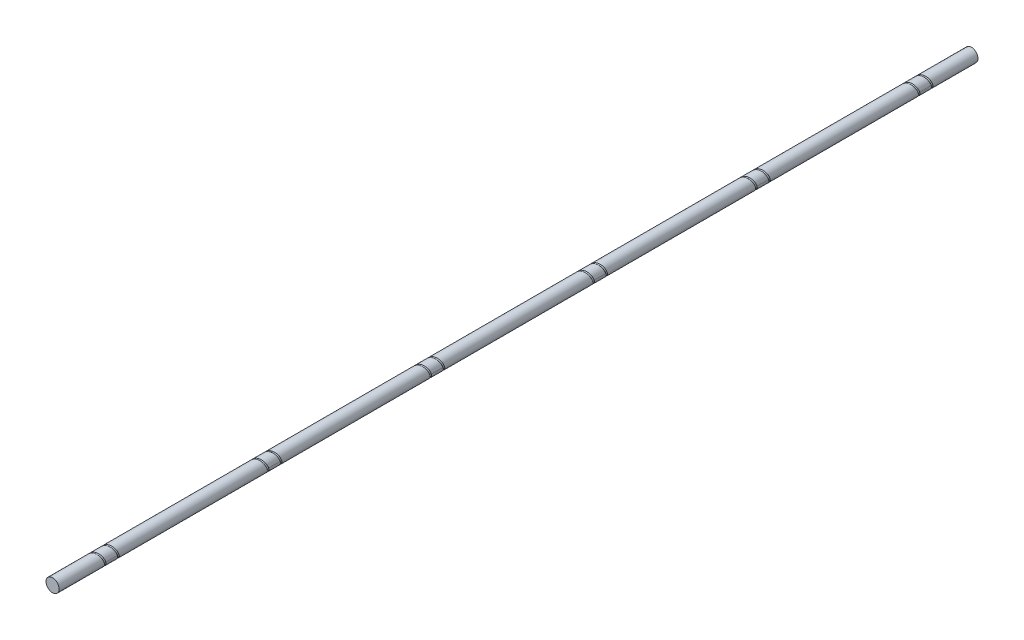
from build123d import *

# Parameters (mm, degrees)
SKETCH1_R              = 25
BOSS_EXTRUDE1_DEPTH    = 3500
CUT_SWEEP1_PITCH       = 50
CUT_SWEEP1_HEIGHT      = 100
CUT_SWEEP1_RADIUS      = 27.646
CUT_SWEEP1_START_ANGLE = -180
SKETCH3_R              = 3.969
LPATTERN1_COUNT        = 6
LPATTERN1_PITCH        = 620


with BuildPart() as part:
    # Sketch1 → Boss-Extrude1 (new body)
    with BuildSketch(Plane.XY):
        Circle(SKETCH1_R)
    extrude(amount=BOSS_EXTRUDE1_DEPTH)

    # Cut-Sweep1: sweep along a helix
    with BuildLine() as cut_sweep1_path:
        add(Helix(CUT_SWEEP1_PITCH, CUT_SWEEP1_HEIGHT, CUT_SWEEP1_RADIUS, center=(0, 0, 150), direction=(0, 0, 1), mode=Mode.PRIVATE).rotate(Axis((0, 0, 150), (0, 0, 1)), CUT_SWEEP1_START_ANGLE))
    # Sketch3 → Cut-Sweep1 (sweep, cut)
    with BuildSketch(Plane(origin=(0, 0, 0), x_dir=(1, 0, 0), z_dir=(0, 1, 0))):
        with Locations((-27.646, -150)):
            Circle(SKETCH3_R)
    cut_sweep1 = sweep(path=cut_sweep1_path.line, is_frenet=True, mode=Mode.SUBTRACT)

    # LPattern1: Cut-Sweep1 ×6
    with Locations(*[(0, 0, i * LPATTERN1_PITCH) for i in range(1, LPATTERN1_COUNT)]):
        add(cut_sweep1, mode=Mode.SUBTRACT)


solid = part.part
